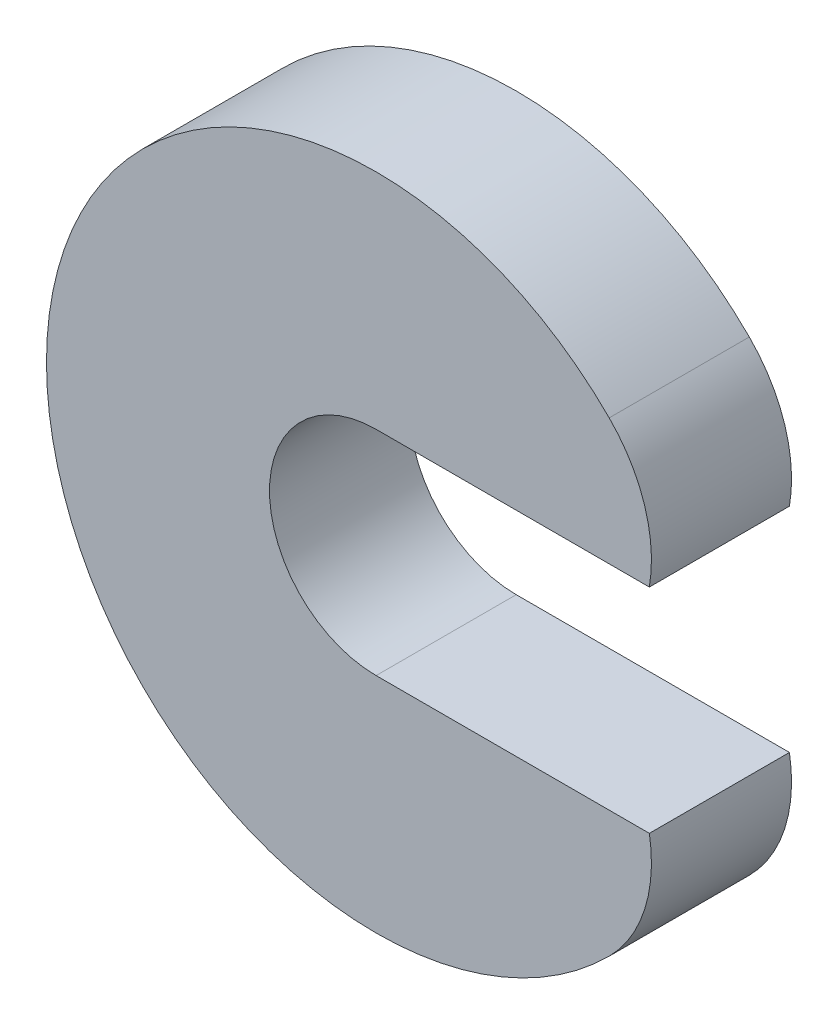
from build123d import *

# Parameters (mm, degrees)
EXTRUDE_1_DEPTH = 170


with BuildPart() as part:
    # Sketch 1 → Extrude 1 (new body)
    with BuildSketch(Plane.XY):
        with BuildLine():
            Line((0, -129.39001705), (310, -129.39001705))
            Line((310, -129.39001705), (331.55880311, -129.39001705))
            ThreePointArc((331.55880311, -129.39001705), (325.895474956, -212.05131125), (282.842712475, -282.842712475))
            ThreePointArc((282.842712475, -282.842712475), (-400, 0), (282.842712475, 282.842712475))
            ThreePointArc((282.842712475, 282.842712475), (325.895474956, 212.05131125), (331.55880311, 129.39001705))
            Line((331.55880311, 129.39001705), (310, 129.39001705))
            Line((310, 129.39001705), (0, 129.39001705))
            ThreePointArc((0, 129.39001705), (-129.39001705, 0), (0, -129.39001705))
        make_face()
    extrude(amount=EXTRUDE_1_DEPTH)


solid = part.part
